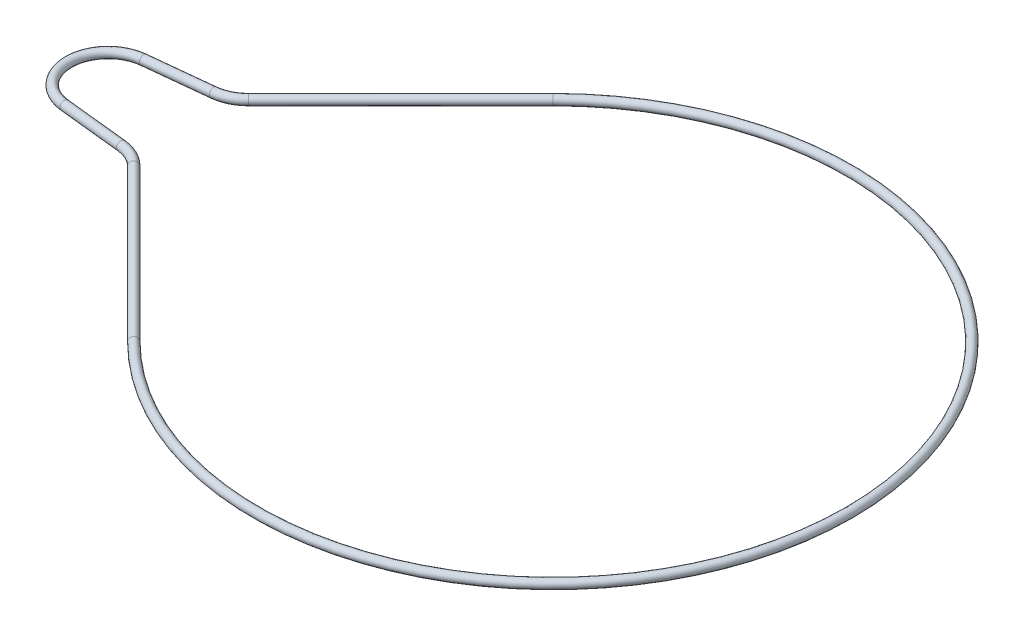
ISO-10303-21;
HEADER;
FILE_DESCRIPTION(('STEP AP214'),'2;1');
FILE_NAME('part.step','',(''),(''),'','','');
FILE_SCHEMA(('AUTOMOTIVE_DESIGN { 1 0 10303 214 1 1 1 1 }'));
ENDSEC;
DATA;
#1=APPLICATION_CONTEXT('core data for automotive mechanical design processes');
#2=APPLICATION_PROTOCOL_DEFINITION('international standard','automotive_design',2000,#1);
#3=PRODUCT_CONTEXT('',#1,'mechanical');
#4=PRODUCT('Part','Part','',(#3));
#5=PRODUCT_RELATED_PRODUCT_CATEGORY('part','',(#4));
#6=PRODUCT_DEFINITION_FORMATION('','',#4);
#7=PRODUCT_DEFINITION_CONTEXT('part definition',#1,'design');
#8=PRODUCT_DEFINITION('design','',#6,#7);
#9=PRODUCT_DEFINITION_SHAPE('','',#8);
#10=(LENGTH_UNIT() NAMED_UNIT(*) SI_UNIT(.MILLI.,.METRE.));
#11=(NAMED_UNIT(*) PLANE_ANGLE_UNIT() SI_UNIT($,.RADIAN.));
#12=(NAMED_UNIT(*) SI_UNIT($,.STERADIAN.) SOLID_ANGLE_UNIT());
#13=UNCERTAINTY_MEASURE_WITH_UNIT(LENGTH_MEASURE(1.E-05),#10,'distance_accuracy_value','');
#14=(GEOMETRIC_REPRESENTATION_CONTEXT(3) GLOBAL_UNCERTAINTY_ASSIGNED_CONTEXT((#13)) GLOBAL_UNIT_ASSIGNED_CONTEXT((#10,
#11,#12)) REPRESENTATION_CONTEXT('',''));
#15=CARTESIAN_POINT('',(0.,0.,0.));
#16=DIRECTION('',(0.,0.,1.));
#17=DIRECTION('',(1.,0.,0.));
#18=AXIS2_PLACEMENT_3D('',#15,#16,#17);
#19=CARTESIAN_POINT('',(-177.011369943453,0.,38.8259039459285));
#20=DIRECTION('',(0.,1.,0.));
#21=DIRECTION('',(0.,0.,1.));
#22=AXIS2_PLACEMENT_3D('',#19,#20,#21);
#23=TOROIDAL_SURFACE('',#22,18.,2.000000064);
#24=CARTESIAN_POINT('',(-164.283447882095,0.,26.0979818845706));
#25=DIRECTION('',(0.707106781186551,0.,0.707106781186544));
#26=DIRECTION('',(0.707106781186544,0.,-0.707106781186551));
#27=AXIS2_PLACEMENT_3D('',#24,#25,#26);
#28=CIRCLE('',#27,2.000000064);
#29=CARTESIAN_POINT('',(-162.869234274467,0.,24.6837682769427));
#30=VERTEX_POINT('',#29);
#31=EDGE_CURVE('E110',#30,#30,#28,.T.);
#32=CARTESIAN_POINT('',(-175.129857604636,0.,20.9245098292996));
#33=DIRECTION('',(0.994521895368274,0.,0.104528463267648));
#34=DIRECTION('',(0.104528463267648,0.,-0.994521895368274));
#35=AXIS2_PLACEMENT_3D('',#32,#33,#34);
#36=CIRCLE('',#35,2.000000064);
#37=CARTESIAN_POINT('',(-174.92080067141,0.,18.9354659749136));
#38=VERTEX_POINT('',#37);
#39=EDGE_CURVE('E107',#38,#38,#36,.T.);
#40=CARTESIAN_POINT('',(-177.011369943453,0.,38.8259039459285));
#41=DIRECTION('',(0.,1.,0.));
#42=DIRECTION('',(0.,0.,1.));
#43=AXIS2_PLACEMENT_3D('',#40,#41,#42);
#44=CIRCLE('',#43,20.000000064);
#45=EDGE_CURVE('',#30,#38,#44,.T.);
#46=ORIENTED_EDGE('',*,*,#31,.F.);
#47=ORIENTED_EDGE('',*,*,#39,.T.);
#48=ORIENTED_EDGE('',*,*,#45,.T.);
#49=ORIENTED_EDGE('',*,*,#45,.F.);
#50=EDGE_LOOP('',(#46,#48,#47,#49));
#51=FACE_BOUND('',#50,.T.);
#52=ADVANCED_FACE('F81',(#51),#23,.T.);
#53=CARTESIAN_POINT('',(-175.129857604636,0.,20.9245098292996));
#54=DIRECTION('',(-0.994521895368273,0.,-0.104528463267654));
#55=DIRECTION('',(-0.104528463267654,0.,0.994521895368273));
#56=AXIS2_PLACEMENT_3D('',#53,#54,#55);
#57=CYLINDRICAL_SURFACE('',#56,2.000000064);
#58=CARTESIAN_POINT('',(-203.892882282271,0.,17.9013941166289));
#59=DIRECTION('',(0.994521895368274,0.,0.104528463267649));
#60=DIRECTION('',(0.104528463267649,0.,-0.994521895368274));
#61=AXIS2_PLACEMENT_3D('',#58,#59,#60);
#62=CIRCLE('',#61,2.000000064);
#63=CARTESIAN_POINT('',(-204.101939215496,0.,19.8904379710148));
#64=VERTEX_POINT('',#63);
#65=EDGE_CURVE('E104',#64,#64,#62,.T.);
#66=ORIENTED_EDGE('',*,*,#65,.T.);
#67=EDGE_LOOP('',(#66));
#68=FACE_BOUND('',#67,.T.);
#69=ORIENTED_EDGE('',*,*,#39,.F.);
#70=EDGE_LOOP('',(#69));
#71=FACE_BOUND('',#70,.T.);
#72=ADVANCED_FACE('F117',(#68,#71),#57,.T.);
#73=CARTESIAN_POINT('',(-202.011369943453,0.,0.));
#74=DIRECTION('',(0.,-1.,0.));
#75=DIRECTION('',(0.,0.,-1.));
#76=AXIS2_PLACEMENT_3D('',#73,#74,#75);
#77=TOROIDAL_SURFACE('',#76,18.,2.000000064);
#78=CARTESIAN_POINT('',(-203.892882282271,0.,-17.9013941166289));
#79=DIRECTION('',(-0.994521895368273,0.,0.104528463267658));
#80=DIRECTION('',(0.104528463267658,0.,0.994521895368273));
#81=AXIS2_PLACEMENT_3D('',#78,#79,#80);
#82=CIRCLE('',#81,2.000000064);
#83=CARTESIAN_POINT('',(-204.101939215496,0.,-19.8904379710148));
#84=VERTEX_POINT('',#83);
#85=EDGE_CURVE('E101',#84,#84,#82,.T.);
#86=CARTESIAN_POINT('',(-202.011369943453,0.,0.));
#87=DIRECTION('',(0.,-1.,0.));
#88=DIRECTION('',(0.,0.,-1.));
#89=AXIS2_PLACEMENT_3D('',#86,#87,#88);
#90=CIRCLE('',#89,20.000000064);
#91=EDGE_CURVE('',#64,#84,#90,.T.);
#92=ORIENTED_EDGE('',*,*,#65,.F.);
#93=ORIENTED_EDGE('',*,*,#85,.T.);
#94=ORIENTED_EDGE('',*,*,#91,.T.);
#95=ORIENTED_EDGE('',*,*,#91,.F.);
#96=EDGE_LOOP('',(#92,#94,#93,#95));
#97=FACE_BOUND('',#96,.T.);
#98=ADVANCED_FACE('F123',(#97),#77,.T.);
#99=CARTESIAN_POINT('',(-203.892882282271,0.,-17.9013941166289));
#100=DIRECTION('',(0.994521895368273,0.,-0.104528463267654));
#101=DIRECTION('',(-0.104528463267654,0.,-0.994521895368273));
#102=AXIS2_PLACEMENT_3D('',#99,#100,#101);
#103=CYLINDRICAL_SURFACE('',#102,2.000000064);
#104=CARTESIAN_POINT('',(-175.129857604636,0.,-20.9245098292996));
#105=DIRECTION('',(-0.994521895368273,0.,0.104528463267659));
#106=DIRECTION('',(0.104528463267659,0.,0.994521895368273));
#107=AXIS2_PLACEMENT_3D('',#104,#105,#106);
#108=CIRCLE('',#107,2.000000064);
#109=CARTESIAN_POINT('',(-174.92080067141,0.,-18.9354659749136));
#110=VERTEX_POINT('',#109);
#111=EDGE_CURVE('E96',#110,#110,#108,.T.);
#112=ORIENTED_EDGE('',*,*,#111,.T.);
#113=EDGE_LOOP('',(#112));
#114=FACE_BOUND('',#113,.T.);
#115=ORIENTED_EDGE('',*,*,#85,.F.);
#116=EDGE_LOOP('',(#115));
#117=FACE_BOUND('',#116,.T.);
#118=ADVANCED_FACE('F129',(#114,#117),#103,.T.);
#119=CARTESIAN_POINT('',(-177.011369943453,0.,-38.8259039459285));
#120=DIRECTION('',(0.,1.,0.));
#121=DIRECTION('',(0.,0.,1.));
#122=AXIS2_PLACEMENT_3D('',#119,#120,#121);
#123=TOROIDAL_SURFACE('',#122,18.,2.000000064);
#124=CARTESIAN_POINT('',(-164.283447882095,0.,-26.0979818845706));
#125=DIRECTION('',(-0.707106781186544,0.,0.707106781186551));
#126=DIRECTION('',(0.707106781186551,0.,0.707106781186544));
#127=AXIS2_PLACEMENT_3D('',#124,#125,#126);
#128=CIRCLE('',#127,2.000000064);
#129=CARTESIAN_POINT('',(-162.869234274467,0.,-24.6837682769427));
#130=VERTEX_POINT('',#129);
#131=EDGE_CURVE('E92',#130,#130,#128,.T.);
#132=CARTESIAN_POINT('',(-177.011369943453,0.,-38.8259039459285));
#133=DIRECTION('',(0.,1.,0.));
#134=DIRECTION('',(0.,0.,1.));
#135=AXIS2_PLACEMENT_3D('',#132,#133,#134);
#136=CIRCLE('',#135,20.000000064);
#137=EDGE_CURVE('',#110,#130,#136,.T.);
#138=ORIENTED_EDGE('',*,*,#111,.F.);
#139=ORIENTED_EDGE('',*,*,#131,.T.);
#140=ORIENTED_EDGE('',*,*,#137,.T.);
#141=ORIENTED_EDGE('',*,*,#137,.F.);
#142=EDGE_LOOP('',(#138,#140,#139,#141));
#143=FACE_BOUND('',#142,.T.);
#144=ADVANCED_FACE('F133',(#143),#123,.T.);
#145=CARTESIAN_POINT('',(-164.283447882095,0.,-26.0979818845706));
#146=DIRECTION('',(0.707106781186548,0.,-0.707106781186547));
#147=DIRECTION('',(-0.707106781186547,0.,-0.707106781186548));
#148=AXIS2_PLACEMENT_3D('',#145,#146,#147);
#149=CYLINDRICAL_SURFACE('',#148,2.000000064);
#150=CARTESIAN_POINT('',(-95.190714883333,0.,-95.190714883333));
#151=DIRECTION('',(-0.707106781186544,0.,0.707106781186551));
#152=DIRECTION('',(0.707106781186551,0.,0.707106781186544));
#153=AXIS2_PLACEMENT_3D('',#150,#151,#152);
#154=CIRCLE('',#153,2.000000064);
#155=CARTESIAN_POINT('',(-96.6049284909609,0.,-96.6049284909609));
#156=VERTEX_POINT('',#155);
#157=EDGE_CURVE('E88',#156,#156,#154,.T.);
#158=ORIENTED_EDGE('',*,*,#157,.T.);
#159=EDGE_LOOP('',(#158));
#160=FACE_BOUND('',#159,.T.);
#161=ORIENTED_EDGE('',*,*,#131,.F.);
#162=EDGE_LOOP('',(#161));
#163=FACE_BOUND('',#162,.T.);
#164=ADVANCED_FACE('F137',(#160,#163),#149,.T.);
#165=CARTESIAN_POINT('',(0.,0.,0.));
#166=DIRECTION('',(0.,-1.,0.));
#167=DIRECTION('',(0.,0.,-1.));
#168=AXIS2_PLACEMENT_3D('',#165,#166,#167);
#169=TOROIDAL_SURFACE('',#168,134.62,2.000000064);
#170=CARTESIAN_POINT('',(-95.190714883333,0.,95.1907148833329));
#171=DIRECTION('',(0.707106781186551,0.,0.707106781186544));
#172=DIRECTION('',(0.707106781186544,0.,-0.707106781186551));
#173=AXIS2_PLACEMENT_3D('',#170,#171,#172);
#174=CIRCLE('',#173,2.000000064);
#175=CARTESIAN_POINT('',(-96.6049284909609,0.,96.6049284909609));
#176=VERTEX_POINT('',#175);
#177=EDGE_CURVE('E11',#176,#176,#174,.T.);
#178=CARTESIAN_POINT('',(0.,0.,0.));
#179=DIRECTION('',(0.,-1.,0.));
#180=DIRECTION('',(0.,0.,-1.));
#181=AXIS2_PLACEMENT_3D('',#178,#179,#180);
#182=CIRCLE('',#181,136.620000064);
#183=EDGE_CURVE('',#156,#176,#182,.T.);
#184=ORIENTED_EDGE('',*,*,#157,.F.);
#185=ORIENTED_EDGE('',*,*,#177,.T.);
#186=ORIENTED_EDGE('',*,*,#183,.T.);
#187=ORIENTED_EDGE('',*,*,#183,.F.);
#188=EDGE_LOOP('',(#184,#186,#185,#187));
#189=FACE_BOUND('',#188,.T.);
#190=ADVANCED_FACE('F140',(#189),#169,.T.);
#191=CARTESIAN_POINT('',(-95.190714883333,0.,95.1907148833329));
#192=DIRECTION('',(-0.707106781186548,0.,-0.707106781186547));
#193=DIRECTION('',(-0.707106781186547,0.,0.707106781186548));
#194=AXIS2_PLACEMENT_3D('',#191,#192,#193);
#195=CYLINDRICAL_SURFACE('',#194,2.000000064);
#196=ORIENTED_EDGE('',*,*,#31,.T.);
#197=EDGE_LOOP('',(#196));
#198=FACE_BOUND('',#197,.T.);
#199=ORIENTED_EDGE('',*,*,#177,.F.);
#200=EDGE_LOOP('',(#199));
#201=FACE_BOUND('',#200,.T.);
#202=ADVANCED_FACE('F83',(#198,#201),#195,.T.);
#203=CLOSED_SHELL('',(#52,#72,#98,#118,#144,#164,#190,#202));
#204=MANIFOLD_SOLID_BREP('B2',#203);
#205=ADVANCED_BREP_SHAPE_REPRESENTATION('',(#18,#204),#14);
#206=SHAPE_DEFINITION_REPRESENTATION(#9,#205);
ENDSEC;
END-ISO-10303-21;
